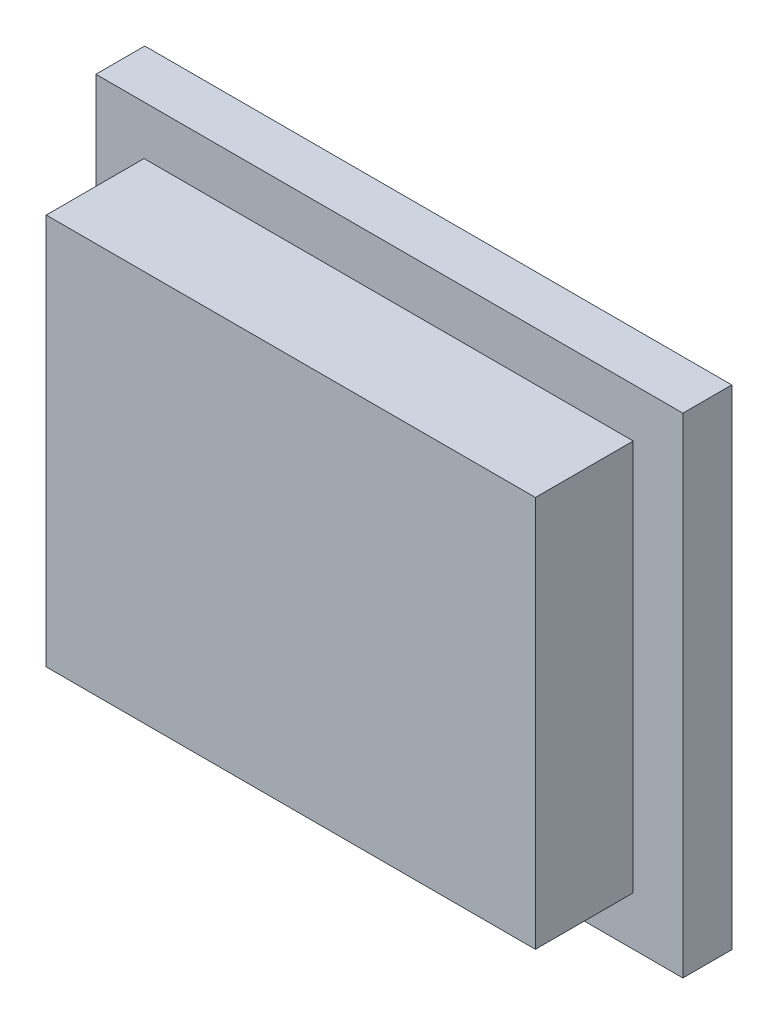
ISO-10303-21;
HEADER;
FILE_DESCRIPTION(('STEP AP214'),'2;1');
FILE_NAME('part.step','',(''),(''),'','','');
FILE_SCHEMA(('AUTOMOTIVE_DESIGN { 1 0 10303 214 1 1 1 1 }'));
ENDSEC;
DATA;
#1=APPLICATION_CONTEXT('core data for automotive mechanical design processes');
#2=APPLICATION_PROTOCOL_DEFINITION('international standard','automotive_design',2000,#1);
#3=PRODUCT_CONTEXT('',#1,'mechanical');
#4=PRODUCT('Part','Part','',(#3));
#5=PRODUCT_RELATED_PRODUCT_CATEGORY('part','',(#4));
#6=PRODUCT_DEFINITION_FORMATION('','',#4);
#7=PRODUCT_DEFINITION_CONTEXT('part definition',#1,'design');
#8=PRODUCT_DEFINITION('design','',#6,#7);
#9=PRODUCT_DEFINITION_SHAPE('','',#8);
#10=(LENGTH_UNIT() NAMED_UNIT(*) SI_UNIT(.MILLI.,.METRE.));
#11=(NAMED_UNIT(*) PLANE_ANGLE_UNIT() SI_UNIT($,.RADIAN.));
#12=(NAMED_UNIT(*) SI_UNIT($,.STERADIAN.) SOLID_ANGLE_UNIT());
#13=UNCERTAINTY_MEASURE_WITH_UNIT(LENGTH_MEASURE(1.E-05),#10,'distance_accuracy_value','');
#14=(GEOMETRIC_REPRESENTATION_CONTEXT(3) GLOBAL_UNCERTAINTY_ASSIGNED_CONTEXT((#13)) GLOBAL_UNIT_ASSIGNED_CONTEXT((#10,
#11,#12)) REPRESENTATION_CONTEXT('',''));
#15=CARTESIAN_POINT('',(0.,0.,0.));
#16=DIRECTION('',(0.,0.,1.));
#17=DIRECTION('',(1.,0.,0.));
#18=AXIS2_PLACEMENT_3D('',#15,#16,#17);
#19=CARTESIAN_POINT('',(23.6011489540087,-5.10716234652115,2.));
#20=DIRECTION('',(-1.,0.,0.));
#21=DIRECTION('',(0.,0.,1.));
#22=AXIS2_PLACEMENT_3D('',#19,#20,#21);
#23=PLANE('',#22);
#24=DIRECTION('',(0.,1.,0.));
#25=VECTOR('',#24,1.);
#26=CARTESIAN_POINT('',(23.6011489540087,-5.10716234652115,0.));
#27=LINE('',#26,#25);
#28=CARTESIAN_POINT('',(23.6011489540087,-13.1071623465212,0.));
#29=VERTEX_POINT('',#28);
#30=CARTESIAN_POINT('',(23.6011489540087,-5.10716234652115,0.));
#31=VERTEX_POINT('',#30);
#32=EDGE_CURVE('E118',#29,#31,#27,.T.);
#33=ORIENTED_EDGE('',*,*,#32,.T.);
#34=DIRECTION('',(0.,0.,-1.));
#35=VECTOR('',#34,1.);
#36=CARTESIAN_POINT('',(23.6011489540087,-5.10716234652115,2.));
#37=LINE('',#36,#35);
#38=CARTESIAN_POINT('',(23.6011489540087,-5.10716234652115,2.));
#39=VERTEX_POINT('',#38);
#40=EDGE_CURVE('E11',#39,#31,#37,.T.);
#41=ORIENTED_EDGE('',*,*,#40,.F.);
#42=DIRECTION('',(0.,1.,0.));
#43=VECTOR('',#42,1.);
#44=CARTESIAN_POINT('',(23.6011489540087,-5.10716234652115,2.));
#45=LINE('',#44,#43);
#46=CARTESIAN_POINT('',(23.6011489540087,-13.1071623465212,2.));
#47=VERTEX_POINT('',#46);
#48=EDGE_CURVE('E127',#47,#39,#45,.T.);
#49=ORIENTED_EDGE('',*,*,#48,.F.);
#50=DIRECTION('',(0.,0.,-1.));
#51=VECTOR('',#50,1.);
#52=CARTESIAN_POINT('',(23.6011489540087,-13.1071623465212,2.));
#53=LINE('',#52,#51);
#54=EDGE_CURVE('E134',#47,#29,#53,.T.);
#55=ORIENTED_EDGE('',*,*,#54,.T.);
#56=EDGE_LOOP('',(#33,#41,#49,#55));
#57=FACE_BOUND('',#56,.T.);
#58=ADVANCED_FACE('F33',(#57),#23,.F.);
#59=CARTESIAN_POINT('',(13.6011489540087,-5.10716234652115,2.));
#60=DIRECTION('',(0.,-1.,0.));
#61=DIRECTION('',(0.,0.,-1.));
#62=AXIS2_PLACEMENT_3D('',#59,#60,#61);
#63=PLANE('',#62);
#64=DIRECTION('',(-1.,0.,0.));
#65=VECTOR('',#64,1.);
#66=CARTESIAN_POINT('',(13.6011489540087,-5.10716234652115,0.));
#67=LINE('',#66,#65);
#68=CARTESIAN_POINT('',(13.6011489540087,-5.10716234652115,0.));
#69=VERTEX_POINT('',#68);
#70=EDGE_CURVE('E121',#31,#69,#67,.T.);
#71=ORIENTED_EDGE('',*,*,#70,.T.);
#72=DIRECTION('',(0.,0.,-1.));
#73=VECTOR('',#72,1.);
#74=CARTESIAN_POINT('',(13.6011489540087,-5.10716234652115,2.));
#75=LINE('',#74,#73);
#76=CARTESIAN_POINT('',(13.6011489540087,-5.10716234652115,2.));
#77=VERTEX_POINT('',#76);
#78=EDGE_CURVE('E41',#77,#69,#75,.T.);
#79=ORIENTED_EDGE('',*,*,#78,.F.);
#80=DIRECTION('',(-1.,0.,0.));
#81=VECTOR('',#80,1.);
#82=CARTESIAN_POINT('',(13.6011489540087,-5.10716234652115,2.));
#83=LINE('',#82,#81);
#84=EDGE_CURVE('E129',#39,#77,#83,.T.);
#85=ORIENTED_EDGE('',*,*,#84,.F.);
#86=ORIENTED_EDGE('',*,*,#40,.T.);
#87=EDGE_LOOP('',(#71,#79,#85,#86));
#88=FACE_BOUND('',#87,.T.);
#89=ADVANCED_FACE('F154',(#88),#63,.F.);
#90=CARTESIAN_POINT('',(13.6011489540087,-5.10716234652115,2.));
#91=DIRECTION('',(1.,0.,0.));
#92=DIRECTION('',(0.,0.,-1.));
#93=AXIS2_PLACEMENT_3D('',#90,#91,#92);
#94=PLANE('',#93);
#95=DIRECTION('',(0.,-1.,0.));
#96=VECTOR('',#95,1.);
#97=CARTESIAN_POINT('',(13.6011489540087,-5.10716234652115,0.));
#98=LINE('',#97,#96);
#99=CARTESIAN_POINT('',(13.6011489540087,-13.1071623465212,0.));
#100=VERTEX_POINT('',#99);
#101=EDGE_CURVE('E138',#69,#100,#98,.T.);
#102=ORIENTED_EDGE('',*,*,#101,.T.);
#103=DIRECTION('',(0.,0.,-1.));
#104=VECTOR('',#103,1.);
#105=CARTESIAN_POINT('',(13.6011489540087,-13.1071623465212,2.));
#106=LINE('',#105,#104);
#107=CARTESIAN_POINT('',(13.6011489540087,-13.1071623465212,2.));
#108=VERTEX_POINT('',#107);
#109=EDGE_CURVE('E145',#108,#100,#106,.T.);
#110=ORIENTED_EDGE('',*,*,#109,.F.);
#111=DIRECTION('',(0.,-1.,0.));
#112=VECTOR('',#111,1.);
#113=CARTESIAN_POINT('',(13.6011489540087,-5.10716234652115,2.));
#114=LINE('',#113,#112);
#115=EDGE_CURVE('E132',#77,#108,#114,.T.);
#116=ORIENTED_EDGE('',*,*,#115,.F.);
#117=ORIENTED_EDGE('',*,*,#78,.T.);
#118=EDGE_LOOP('',(#102,#110,#116,#117));
#119=FACE_BOUND('',#118,.T.);
#120=ADVANCED_FACE('F151',(#119),#94,.F.);
#121=CARTESIAN_POINT('',(13.6011489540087,-13.1071623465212,2.));
#122=DIRECTION('',(0.,1.,0.));
#123=DIRECTION('',(0.,0.,1.));
#124=AXIS2_PLACEMENT_3D('',#121,#122,#123);
#125=PLANE('',#124);
#126=DIRECTION('',(1.,0.,0.));
#127=VECTOR('',#126,1.);
#128=CARTESIAN_POINT('',(13.6011489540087,-13.1071623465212,0.));
#129=LINE('',#128,#127);
#130=EDGE_CURVE('E130',#100,#29,#129,.T.);
#131=ORIENTED_EDGE('',*,*,#130,.T.);
#132=ORIENTED_EDGE('',*,*,#54,.F.);
#133=DIRECTION('',(1.,0.,0.));
#134=VECTOR('',#133,1.);
#135=CARTESIAN_POINT('',(13.6011489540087,-13.1071623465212,2.));
#136=LINE('',#135,#134);
#137=EDGE_CURVE('E48',#108,#47,#136,.T.);
#138=ORIENTED_EDGE('',*,*,#137,.F.);
#139=ORIENTED_EDGE('',*,*,#109,.T.);
#140=EDGE_LOOP('',(#131,#132,#138,#139));
#141=FACE_BOUND('',#140,.T.);
#142=ADVANCED_FACE('F160',(#141),#125,.F.);
#143=CARTESIAN_POINT('',(23.6011489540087,-13.1071623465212,2.));
#144=DIRECTION('',(0.,0.,1.));
#145=DIRECTION('',(1.,0.,0.));
#146=AXIS2_PLACEMENT_3D('',#143,#144,#145);
#147=PLANE('',#146);
#148=ORIENTED_EDGE('',*,*,#48,.T.);
#149=ORIENTED_EDGE('',*,*,#84,.T.);
#150=ORIENTED_EDGE('',*,*,#115,.T.);
#151=ORIENTED_EDGE('',*,*,#137,.T.);
#152=EDGE_LOOP('',(#148,#149,#150,#151));
#153=FACE_BOUND('',#152,.T.);
#154=ADVANCED_FACE('F163',(#153),#147,.T.);
#155=CARTESIAN_POINT('',(12.6159747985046,-14.1071623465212,0.));
#156=DIRECTION('',(0.,0.,-1.));
#157=DIRECTION('',(-1.,0.,0.));
#158=AXIS2_PLACEMENT_3D('',#155,#156,#157);
#159=PLANE('',#158);
#160=DIRECTION('',(0.,1.,0.));
#161=VECTOR('',#160,1.);
#162=CARTESIAN_POINT('',(12.6159747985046,-4.10716234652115,0.));
#163=LINE('',#162,#161);
#164=CARTESIAN_POINT('',(12.6159747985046,-14.1071623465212,0.));
#165=VERTEX_POINT('',#164);
#166=CARTESIAN_POINT('',(12.6159747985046,-4.10716234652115,0.));
#167=VERTEX_POINT('',#166);
#168=EDGE_CURVE('E117',#165,#167,#163,.T.);
#169=ORIENTED_EDGE('',*,*,#168,.F.);
#170=DIRECTION('',(-1.,0.,0.));
#171=VECTOR('',#170,1.);
#172=CARTESIAN_POINT('',(24.6159747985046,-14.1071623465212,0.));
#173=LINE('',#172,#171);
#174=CARTESIAN_POINT('',(24.6159747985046,-14.1071623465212,0.));
#175=VERTEX_POINT('',#174);
#176=EDGE_CURVE('E113',#175,#165,#173,.T.);
#177=ORIENTED_EDGE('',*,*,#176,.F.);
#178=DIRECTION('',(0.,-1.,0.));
#179=VECTOR('',#178,1.);
#180=CARTESIAN_POINT('',(24.6159747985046,-4.10716234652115,0.));
#181=LINE('',#180,#179);
#182=CARTESIAN_POINT('',(24.6159747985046,-4.10716234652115,0.));
#183=VERTEX_POINT('',#182);
#184=EDGE_CURVE('E247',#183,#175,#181,.T.);
#185=ORIENTED_EDGE('',*,*,#184,.F.);
#186=DIRECTION('',(1.,0.,0.));
#187=VECTOR('',#186,1.);
#188=CARTESIAN_POINT('',(24.6159747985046,-4.10716234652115,0.));
#189=LINE('',#188,#187);
#190=EDGE_CURVE('E250',#167,#183,#189,.T.);
#191=ORIENTED_EDGE('',*,*,#190,.F.);
#192=EDGE_LOOP('',(#169,#177,#185,#191));
#193=FACE_BOUND('',#192,.T.);
#194=ORIENTED_EDGE('',*,*,#70,.F.);
#195=ORIENTED_EDGE('',*,*,#32,.F.);
#196=ORIENTED_EDGE('',*,*,#130,.F.);
#197=ORIENTED_EDGE('',*,*,#101,.F.);
#198=EDGE_LOOP('',(#194,#195,#196,#197));
#199=FACE_BOUND('',#198,.T.);
#200=ADVANCED_FACE('F158',(#193,#199),#159,.F.);
#201=CARTESIAN_POINT('',(12.6159747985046,-4.10716234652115,-1.));
#202=DIRECTION('',(1.,0.,0.));
#203=DIRECTION('',(0.,1.,0.));
#204=AXIS2_PLACEMENT_3D('',#201,#202,#203);
#205=PLANE('',#204);
#206=ORIENTED_EDGE('',*,*,#168,.T.);
#207=DIRECTION('',(0.,0.,1.));
#208=VECTOR('',#207,1.);
#209=CARTESIAN_POINT('',(12.6159747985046,-4.10716234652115,-1.));
#210=LINE('',#209,#208);
#211=CARTESIAN_POINT('',(12.6159747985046,-4.10716234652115,-1.));
#212=VERTEX_POINT('',#211);
#213=EDGE_CURVE('E97',#212,#167,#210,.T.);
#214=ORIENTED_EDGE('',*,*,#213,.F.);
#215=DIRECTION('',(0.,1.,0.));
#216=VECTOR('',#215,1.);
#217=CARTESIAN_POINT('',(12.6159747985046,-4.10716234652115,-1.));
#218=LINE('',#217,#216);
#219=CARTESIAN_POINT('',(12.6159747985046,-14.1071623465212,-1.));
#220=VERTEX_POINT('',#219);
#221=EDGE_CURVE('E104',#220,#212,#218,.T.);
#222=ORIENTED_EDGE('',*,*,#221,.F.);
#223=DIRECTION('',(0.,0.,1.));
#224=VECTOR('',#223,1.);
#225=CARTESIAN_POINT('',(12.6159747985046,-14.1071623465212,-1.));
#226=LINE('',#225,#224);
#227=EDGE_CURVE('E244',#220,#165,#226,.T.);
#228=ORIENTED_EDGE('',*,*,#227,.T.);
#229=EDGE_LOOP('',(#206,#214,#222,#228));
#230=FACE_BOUND('',#229,.T.);
#231=ADVANCED_FACE('F115',(#230),#205,.F.);
#232=CARTESIAN_POINT('',(24.6159747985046,-4.10716234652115,-1.));
#233=DIRECTION('',(0.,-1.,0.));
#234=DIRECTION('',(0.,0.,-1.));
#235=AXIS2_PLACEMENT_3D('',#232,#233,#234);
#236=PLANE('',#235);
#237=ORIENTED_EDGE('',*,*,#190,.T.);
#238=DIRECTION('',(0.,0.,1.));
#239=VECTOR('',#238,1.);
#240=CARTESIAN_POINT('',(24.6159747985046,-4.10716234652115,-1.));
#241=LINE('',#240,#239);
#242=CARTESIAN_POINT('',(24.6159747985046,-4.10716234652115,-1.));
#243=VERTEX_POINT('',#242);
#244=EDGE_CURVE('E100',#243,#183,#241,.T.);
#245=ORIENTED_EDGE('',*,*,#244,.F.);
#246=DIRECTION('',(1.,0.,0.));
#247=VECTOR('',#246,1.);
#248=CARTESIAN_POINT('',(24.6159747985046,-4.10716234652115,-1.));
#249=LINE('',#248,#247);
#250=EDGE_CURVE('E93',#212,#243,#249,.T.);
#251=ORIENTED_EDGE('',*,*,#250,.F.);
#252=ORIENTED_EDGE('',*,*,#213,.T.);
#253=EDGE_LOOP('',(#237,#245,#251,#252));
#254=FACE_BOUND('',#253,.T.);
#255=ADVANCED_FACE('F95',(#254),#236,.F.);
#256=CARTESIAN_POINT('',(24.6159747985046,-4.10716234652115,-1.));
#257=DIRECTION('',(-1.,0.,0.));
#258=DIRECTION('',(0.,-1.,0.));
#259=AXIS2_PLACEMENT_3D('',#256,#257,#258);
#260=PLANE('',#259);
#261=ORIENTED_EDGE('',*,*,#184,.T.);
#262=DIRECTION('',(0.,0.,1.));
#263=VECTOR('',#262,1.);
#264=CARTESIAN_POINT('',(24.6159747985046,-14.1071623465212,-1.));
#265=LINE('',#264,#263);
#266=CARTESIAN_POINT('',(24.6159747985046,-14.1071623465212,-1.));
#267=VERTEX_POINT('',#266);
#268=EDGE_CURVE('E123',#267,#175,#265,.T.);
#269=ORIENTED_EDGE('',*,*,#268,.F.);
#270=DIRECTION('',(0.,-1.,0.));
#271=VECTOR('',#270,1.);
#272=CARTESIAN_POINT('',(24.6159747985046,-4.10716234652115,-1.));
#273=LINE('',#272,#271);
#274=EDGE_CURVE('E103',#243,#267,#273,.T.);
#275=ORIENTED_EDGE('',*,*,#274,.F.);
#276=ORIENTED_EDGE('',*,*,#244,.T.);
#277=EDGE_LOOP('',(#261,#269,#275,#276));
#278=FACE_BOUND('',#277,.T.);
#279=ADVANCED_FACE('F211',(#278),#260,.F.);
#280=CARTESIAN_POINT('',(24.6159747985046,-14.1071623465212,-1.));
#281=DIRECTION('',(0.,1.,0.));
#282=DIRECTION('',(0.,0.,1.));
#283=AXIS2_PLACEMENT_3D('',#280,#281,#282);
#284=PLANE('',#283);
#285=ORIENTED_EDGE('',*,*,#176,.T.);
#286=ORIENTED_EDGE('',*,*,#227,.F.);
#287=DIRECTION('',(-1.,0.,0.));
#288=VECTOR('',#287,1.);
#289=CARTESIAN_POINT('',(24.6159747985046,-14.1071623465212,-1.));
#290=LINE('',#289,#288);
#291=EDGE_CURVE('E109',#267,#220,#290,.T.);
#292=ORIENTED_EDGE('',*,*,#291,.F.);
#293=ORIENTED_EDGE('',*,*,#268,.T.);
#294=EDGE_LOOP('',(#285,#286,#292,#293));
#295=FACE_BOUND('',#294,.T.);
#296=ADVANCED_FACE('F220',(#295),#284,.F.);
#297=CARTESIAN_POINT('',(12.6159747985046,-14.1071623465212,-1.));
#298=DIRECTION('',(0.,0.,-1.));
#299=DIRECTION('',(-1.,0.,0.));
#300=AXIS2_PLACEMENT_3D('',#297,#298,#299);
#301=PLANE('',#300);
#302=ORIENTED_EDGE('',*,*,#221,.T.);
#303=ORIENTED_EDGE('',*,*,#250,.T.);
#304=ORIENTED_EDGE('',*,*,#274,.T.);
#305=ORIENTED_EDGE('',*,*,#291,.T.);
#306=EDGE_LOOP('',(#302,#303,#304,#305));
#307=FACE_BOUND('',#306,.T.);
#308=ADVANCED_FACE('F107',(#307),#301,.T.);
#309=CLOSED_SHELL('',(#58,#89,#120,#142,#154,#200,#231,#255,#279,#296,#308));
#310=MANIFOLD_SOLID_BREP('B2',#309);
#311=ADVANCED_BREP_SHAPE_REPRESENTATION('',(#18,#310),#14);
#312=SHAPE_DEFINITION_REPRESENTATION(#9,#311);
ENDSEC;
END-ISO-10303-21;
